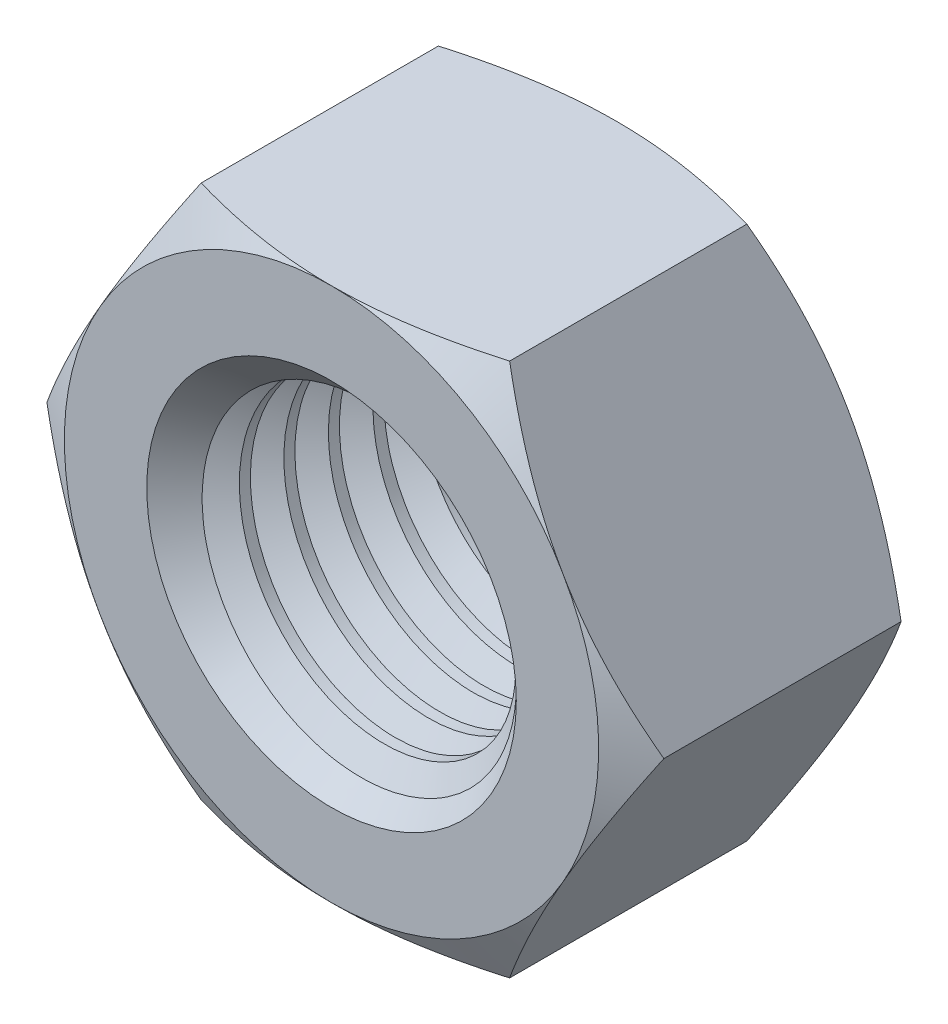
from build123d import *

# Parameters (mm, degrees)
Y_KSEKLIK_EKSTR_ZYON1_DEPTH = 16
IZIM2_OUTSIDE_W             = 101.77599999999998
IZIM2_OUTSIDE_H             = 97.134
IZIM2_OUTSIDE_R             = 15.000000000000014
KES_EKSTR_ZYON1_DEPTH       = 16
KES_EKSTR_ZYON1_DRAFT       = -60.000000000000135
IZIM3_OUTSIDE_W             = 101.77599999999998
IZIM3_OUTSIDE_H             = 97.134
IZIM3_OUTSIDE_R             = 15.00000000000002
KES_EKSTR_ZYON2_DEPTH       = 16
KES_EKSTR_ZYON2_DRAFT       = -60.000000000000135
IZIM4_R                     = 8.375
KES_EKSTR_ZYON3_DEPTH       = 16
PAH1_SIZE                   = 2
KES_S_P_R1_PITCH            = 2.4999999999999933
KES_S_P_R1_HEIGHT           = 19.00000000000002
KES_S_P_R1_RADIUS           = 8.375
KES_S_P_R1_START_ANGLE      = -3.8794e-13


with BuildPart() as part:
    # izim1 → Y_kseklik-Ekstr_zyon1 (new body)
    with BuildSketch(Plane.XY):
        Polygon((17.32050807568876, 5.3e-16), (8.660254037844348, 15.000000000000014), (-8.660254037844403, 15.000000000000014), (-17.320508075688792, 3.11e-15), (-8.660254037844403, -14.999999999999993), (8.660254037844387, -14.999999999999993), align=None)
    extrude(amount=Y_KSEKLIK_EKSTR_ZYON1_DEPTH)


with BuildPart() as kes_ekstr_zyon1_tool:
    # izim2 outside → Kes-Ekstr_zyon1 (with draft: the straight prism first)
    with BuildSketch(Plane.XY.offset(16)):
        Rectangle(IZIM2_OUTSIDE_W, IZIM2_OUTSIDE_H)
        Circle(IZIM2_OUTSIDE_R, mode=Mode.SUBTRACT)
    extrude(amount=-KES_EKSTR_ZYON1_DEPTH)
    # Kes-Ekstr_zyon1: the draft: its side faces are tilted about the plane it starts from
    kes_ekstr_zyon1_sides = [kes_ekstr_zyon1_tool.faces().sort_by_distance(p)[0] for p in [
        (0, -48.567, 8),
        (50.888, 0, 8),
        (0, 48.567, 8),
        (-50.888, 0, 8),
        (-15, 0, 8),
    ]]
    draft(kes_ekstr_zyon1_sides, Plane.XY.offset(16), KES_EKSTR_ZYON1_DRAFT)


with BuildPart() as part_1:
    add(part.part)

    # Kes-Ekstr_zyon1: cut by kes_ekstr_zyon1_tool
    add(kes_ekstr_zyon1_tool.part, mode=Mode.SUBTRACT)


with BuildPart() as kes_ekstr_zyon2_tool:
    # izim3 outside → Kes-Ekstr_zyon2 (with draft: the straight prism first)
    with BuildSketch(Plane(origin=(0, 0, 0), x_dir=(-1, 0, 0), z_dir=(0, 0, -1))):
        Rectangle(IZIM3_OUTSIDE_W, IZIM3_OUTSIDE_H)
        Circle(IZIM3_OUTSIDE_R, mode=Mode.SUBTRACT)
    extrude(amount=-KES_EKSTR_ZYON2_DEPTH)
    # Kes-Ekstr_zyon2: the draft: its side faces are tilted about the plane it starts from
    kes_ekstr_zyon2_sides = [kes_ekstr_zyon2_tool.faces().sort_by_distance(p)[0] for p in [
        (0, -48.567, 8),
        (-50.888, 0, 8),
        (0, 48.567, 8),
        (50.888, 0, 8),
        (15, 0, 8),
    ]]
    draft(kes_ekstr_zyon2_sides, Plane(origin=(0, 0, 0), x_dir=(-1, 0, 0), z_dir=(0, 0, -1)), KES_EKSTR_ZYON2_DRAFT)


with BuildPart() as part_2:
    add(part_1.part)

    # Kes-Ekstr_zyon2: cut by kes_ekstr_zyon2_tool
    add(kes_ekstr_zyon2_tool.part, mode=Mode.SUBTRACT)

    # izim4 → Kes-Ekstr_zyon3 (cut)
    with BuildSketch(Plane(origin=(0, 0, 0), x_dir=(-1, 0, 0), z_dir=(0, 0, -1))):
        Circle(IZIM4_R)
    extrude(amount=-KES_EKSTR_ZYON3_DEPTH, mode=Mode.SUBTRACT)

    # Pah1
    pah1_edges = [part_2.edges().sort_by_distance(p)[0] for p in [
        (8.375, 1.03e-15, 16),
        (8.375, 1.03e-15, 0),
    ]]
    chamfer(pah1_edges, length=PAH1_SIZE)

    # Kes-S_p_r1: sweep along a helix
    with BuildLine() as kes_s_p_r1_path:
        add(Helix(KES_S_P_R1_PITCH, KES_S_P_R1_HEIGHT, KES_S_P_R1_RADIUS, center=(0, 0, 0), direction=(0, 0, 1), mode=Mode.PRIVATE).rotate(Axis((0, 0, 0), (0, 0, 1)), KES_S_P_R1_START_ANGLE))
    # izim6 → Kes-S_p_r1 (sweep, cut)
    with BuildSketch(Plane(origin=(-6.775517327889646, -4.922701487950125, 19.000000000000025), x_dir=(-0.8094977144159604, -0.5861132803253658, 0.03441907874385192), z_dir=(0.5871230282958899, -0.8081055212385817, 0.04745541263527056))):
        Polygon((-0.49885715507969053, -1.2262095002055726), (-0.49885715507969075, 1.2262095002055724), (1.6250000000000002, 0), align=None)
    sweep(path=kes_s_p_r1_path.line, is_frenet=True, mode=Mode.SUBTRACT)


solid = part_2.part
